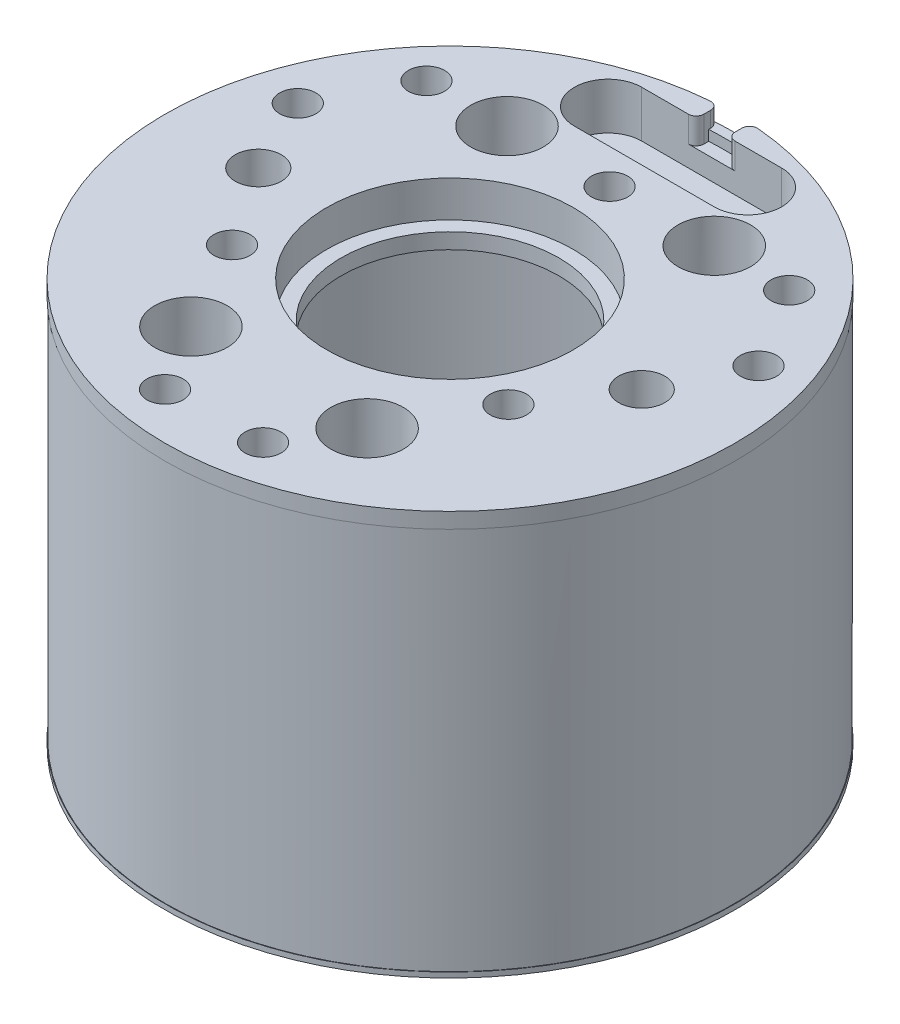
from build123d import *

# Parameters (mm, degrees)
F_2_56_TAPPED_HOLE1_D     = 1.778
CIRPATTERN1_COUNT         = 3
F_4_40_TAPPED_HOLE2_D     = 2.2606
F_4_40_TAPPED_HOLE2_DEPTH = 7.493
F_4_40_TAPPED_HOLE2_TIP   = 0.679152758
SKETCH9_R                 = 1.778
F_4_HOLES_DEPTH           = 28.979227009
SLOT_DEPTH                = 2.286
SKETCH11_W                = 1.524
SKETCH11_H                = 1.143
NOTCH_DEPTH               = 1.27
NOTCH_FILLET_R            = 0.381
SKETCH12_W                = 0.4826
SKETCH12_H                = 18.796


with BuildPart() as part:
    # Sketch1 → Revolve1 (revolve)
    with BuildSketch(Plane.XY, mode=Mode.PRIVATE) as revolve1_sk:
        Polygon((5.334, 18.034), (5.334, 17.272), (13.208, 17.272), (13.208, 0), (13.97, 0), (13.97, 0.254), (13.462, 0.254), (13.462, 19.05), (13.97, 19.05), (13.97, 19.812), (6.0452, 19.812), (6.0452, 18.034), align=None)
    revolve(revolve1_sk.sketch.rotate(Axis((0, 0, 0), (0, 1, 0)), 90), axis=Axis((0, 0, 0), (0, 1, 0)))

    # 2-56 Tapped Hole1 (through all)
    with Locations(Plane(origin=(0, 19.812, 0), x_dir=(-1, 0, 0), z_dir=(0, 1, 0))):
        with Locations((11.176, -3.713931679), (6.773820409, 3.910867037), (2.286, 11.684)):
            f_2_56_tapped_hole1 = Hole(F_2_56_TAPPED_HOLE1_D / 2)

    # CirPattern1: 2-56 Tapped Hole1 ×3 about axis
    cirpattern1_axis = Axis((0, 0, 0), (0, 1, 0))
    for i in range(1, CIRPATTERN1_COUNT):
        add(f_2_56_tapped_hole1.rotate(cirpattern1_axis, i * 360 / CIRPATTERN1_COUNT), mode=Mode.SUBTRACT)

    # 4-40 Tapped Hole2
    with Locations(Plane(origin=(0, 19.812, 0), x_dir=(1, 0, 0), z_dir=(0, 1, 0))):
        with Locations((-9.398, 0), (9.398, 0)):
            Hole(F_4_40_TAPPED_HOLE2_D / 2, depth=F_4_40_TAPPED_HOLE2_DEPTH)
            with Locations((0, 0, -(F_4_40_TAPPED_HOLE2_DEPTH + F_4_40_TAPPED_HOLE2_TIP / 2))):  # 118° drill point
                Cone(0, F_4_40_TAPPED_HOLE2_D / 2, F_4_40_TAPPED_HOLE2_TIP, mode=Mode.SUBTRACT)

    # Sketch9 → 4 Holes (cut, through all)
    with BuildSketch(Plane(origin=(0, 19.812, 0), x_dir=(1, 0, 0), z_dir=(0, 1, 0))):
        with Locations(Location((-4.318, -8.382, 0), (0, 0, 270))):
            Circle(SKETCH9_R)
        with Locations(Location((4.318, -8.382, 0), (0, 0, 270))):
            Circle(SKETCH9_R)
        with Locations(Location((-5.08, 7.874, 0), (0, 0, 270))):
            Circle(SKETCH9_R)
        with Locations(Location((5.08, 7.874, 0), (0, 0, 270))):
            Circle(SKETCH9_R)
    extrude(amount=-F_4_HOLES_DEPTH, mode=Mode.SUBTRACT)

    # Sketch10 → Slot (cut)
    with BuildSketch(Plane(origin=(0, 19.812, 0), x_dir=(1, 0, 0), z_dir=(0, 1, 0))):
        with BuildLine():
            Line((-3.429, 12.827), (3.429, 12.827))
            ThreePointArc((3.429, 12.827), (5.08, 11.176), (3.429, 9.525))
            Line((3.429, 9.525), (-3.429, 9.525))
            ThreePointArc((-3.429, 9.525), (-5.08, 11.176), (-3.429, 12.827))
        make_face()
    extrude(amount=-SLOT_DEPTH, mode=Mode.SUBTRACT)

    # Sketch11 → Notch (cut)
    with BuildSketch(Plane(origin=(0, 19.812, 0), x_dir=(1, 0, 0), z_dir=(0, 1, 0))):
        with Locations((0, 13.3985)):
            Rectangle(SKETCH11_W, SKETCH11_H)
    extrude(amount=-NOTCH_DEPTH, mode=Mode.SUBTRACT)

    # Notch Fillet
    notch_fillet_edges = [part.edges().sort_by_distance(p)[0] for p in [
        (-0.762, 19.431, -13.949202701),
        (0.762, 19.431, -13.949202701),
        (-0.762, 19.177, -12.827),
        (0.762, 19.177, -12.827),
    ]]
    fillet(notch_fillet_edges, radius=NOTCH_FILLET_R)

    # Sketch12 → Coils (revolve)
    with BuildSketch(Plane.XY, mode=Mode.PRIVATE) as coils_sk:
        with Locations((13.7033, 9.652)):
            Rectangle(SKETCH12_W, SKETCH12_H)
    revolve(coils_sk.sketch.rotate(Axis((0, 0, 0), (0, 1, 0)), 94.255646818), axis=Axis((0, 0, 0), (0, 1, 0)))


solid = part.part
